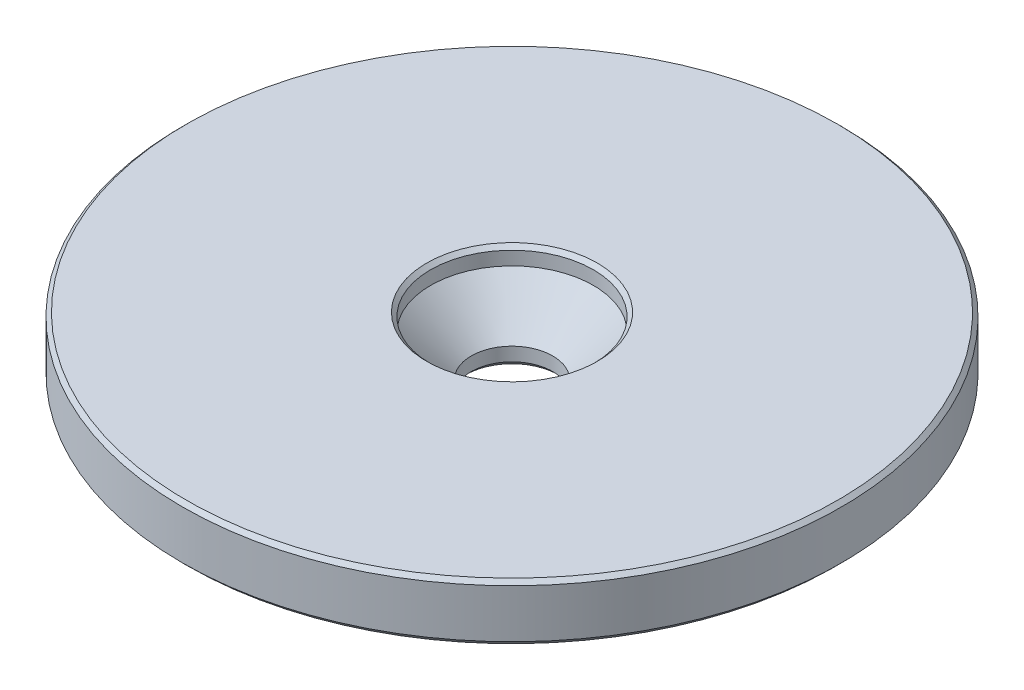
ISO-10303-21;
HEADER;
FILE_DESCRIPTION(('STEP AP214'),'2;1');
FILE_NAME('part.step','',(''),(''),'','','');
FILE_SCHEMA(('AUTOMOTIVE_DESIGN { 1 0 10303 214 1 1 1 1 }'));
ENDSEC;
DATA;
#1=APPLICATION_CONTEXT('core data for automotive mechanical design processes');
#2=APPLICATION_PROTOCOL_DEFINITION('international standard','automotive_design',2000,#1);
#3=PRODUCT_CONTEXT('',#1,'mechanical');
#4=PRODUCT('Part','Part','',(#3));
#5=PRODUCT_RELATED_PRODUCT_CATEGORY('part','',(#4));
#6=PRODUCT_DEFINITION_FORMATION('','',#4);
#7=PRODUCT_DEFINITION_CONTEXT('part definition',#1,'design');
#8=PRODUCT_DEFINITION('design','',#6,#7);
#9=PRODUCT_DEFINITION_SHAPE('','',#8);
#10=(LENGTH_UNIT() NAMED_UNIT(*) SI_UNIT(.MILLI.,.METRE.));
#11=(NAMED_UNIT(*) PLANE_ANGLE_UNIT() SI_UNIT($,.RADIAN.));
#12=(NAMED_UNIT(*) SI_UNIT($,.STERADIAN.) SOLID_ANGLE_UNIT());
#13=UNCERTAINTY_MEASURE_WITH_UNIT(LENGTH_MEASURE(1.E-05),#10,'distance_accuracy_value','');
#14=(GEOMETRIC_REPRESENTATION_CONTEXT(3) GLOBAL_UNCERTAINTY_ASSIGNED_CONTEXT((#13)) GLOBAL_UNIT_ASSIGNED_CONTEXT((#10,
#11,#12)) REPRESENTATION_CONTEXT('',''));
#15=CARTESIAN_POINT('',(0.,0.,0.));
#16=DIRECTION('',(0.,0.,1.));
#17=DIRECTION('',(1.,0.,0.));
#18=AXIS2_PLACEMENT_3D('',#15,#16,#17);
#19=CARTESIAN_POINT('',(-8.,0.,0.));
#20=DIRECTION('',(0.,1.,0.));
#21=DIRECTION('',(0.,0.,1.));
#22=AXIS2_PLACEMENT_3D('',#19,#20,#21);
#23=PLANE('',#22);
#24=CARTESIAN_POINT('',(0.,0.,0.));
#25=DIRECTION('',(0.,1.,0.));
#26=DIRECTION('',(0.,0.,1.));
#27=AXIS2_PLACEMENT_3D('',#24,#25,#26);
#28=CIRCLE('',#27,2.4);
#29=CARTESIAN_POINT('',(0.,0.,2.4));
#30=VERTEX_POINT('',#29);
#31=EDGE_CURVE('E40',#30,#30,#28,.T.);
#32=ORIENTED_EDGE('',*,*,#31,.T.);
#33=EDGE_LOOP('',(#32));
#34=FACE_BOUND('',#33,.T.);
#35=CARTESIAN_POINT('',(0.,0.,0.));
#36=DIRECTION('',(0.,1.,0.));
#37=DIRECTION('',(0.,0.,1.));
#38=AXIS2_PLACEMENT_3D('',#35,#36,#37);
#39=CIRCLE('',#38,7.7);
#40=CARTESIAN_POINT('',(0.,0.,7.7));
#41=VERTEX_POINT('',#40);
#42=EDGE_CURVE('E43',#41,#41,#39,.F.);
#43=ORIENTED_EDGE('',*,*,#42,.T.);
#44=EDGE_LOOP('',(#43));
#45=FACE_BOUND('',#44,.T.);
#46=ADVANCED_FACE('F14',(#34,#45),#23,.F.);
#47=CARTESIAN_POINT('',(0.,0.,0.));
#48=DIRECTION('',(0.,1.,0.));
#49=DIRECTION('',(0.,0.,1.));
#50=AXIS2_PLACEMENT_3D('',#47,#48,#49);
#51=CYLINDRICAL_SURFACE('',#50,8.);
#52=CARTESIAN_POINT('',(0.,0.6,0.));
#53=DIRECTION('',(0.,1.,0.));
#54=DIRECTION('',(0.,0.,1.));
#55=AXIS2_PLACEMENT_3D('',#52,#53,#54);
#56=CIRCLE('',#55,8.);
#57=CARTESIAN_POINT('',(0.,0.6,8.));
#58=VERTEX_POINT('',#57);
#59=EDGE_CURVE('E21',#58,#58,#56,.F.);
#60=ORIENTED_EDGE('',*,*,#59,.T.);
#61=EDGE_LOOP('',(#60));
#62=FACE_BOUND('',#61,.T.);
#63=CARTESIAN_POINT('',(0.,0.300000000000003,0.));
#64=DIRECTION('',(0.,1.,0.));
#65=DIRECTION('',(0.,0.,1.));
#66=AXIS2_PLACEMENT_3D('',#63,#64,#65);
#67=CIRCLE('',#66,8.);
#68=CARTESIAN_POINT('',(0.,0.300000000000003,8.));
#69=VERTEX_POINT('',#68);
#70=EDGE_CURVE('E34',#69,#69,#67,.T.);
#71=ORIENTED_EDGE('',*,*,#70,.T.);
#72=EDGE_LOOP('',(#71));
#73=FACE_BOUND('',#72,.T.);
#74=ADVANCED_FACE('F98',(#62,#73),#51,.T.);
#75=CARTESIAN_POINT('',(0.,0.,0.));
#76=DIRECTION('',(0.,1.,0.));
#77=DIRECTION('',(0.,0.,1.));
#78=AXIS2_PLACEMENT_3D('',#75,#76,#77);
#79=CYLINDRICAL_SURFACE('',#78,2.1);
#80=CARTESIAN_POINT('',(0.,0.299999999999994,0.));
#81=DIRECTION('',(0.,1.,0.));
#82=DIRECTION('',(0.,0.,1.));
#83=AXIS2_PLACEMENT_3D('',#80,#81,#82);
#84=CIRCLE('',#83,2.1);
#85=CARTESIAN_POINT('',(0.,0.299999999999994,2.1));
#86=VERTEX_POINT('',#85);
#87=EDGE_CURVE('E37',#86,#86,#84,.F.);
#88=ORIENTED_EDGE('',*,*,#87,.T.);
#89=EDGE_LOOP('',(#88));
#90=FACE_BOUND('',#89,.T.);
#91=CARTESIAN_POINT('',(0.,0.999999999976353,0.));
#92=DIRECTION('',(0.,1.,0.));
#93=DIRECTION('',(0.,0.,1.));
#94=AXIS2_PLACEMENT_3D('',#91,#92,#93);
#95=CIRCLE('',#94,2.09999999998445);
#96=CARTESIAN_POINT('',(0.,0.999999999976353,2.09999999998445));
#97=VERTEX_POINT('',#96);
#98=EDGE_CURVE('E61',#97,#97,#95,.T.);
#99=ORIENTED_EDGE('',*,*,#98,.T.);
#100=EDGE_LOOP('',(#99));
#101=FACE_BOUND('',#100,.T.);
#102=ADVANCED_FACE('F95',(#90,#101),#79,.F.);
#103=CARTESIAN_POINT('',(-17.,1.,0.));
#104=DIRECTION('',(0.,1.,0.));
#105=DIRECTION('',(0.,0.,1.));
#106=AXIS2_PLACEMENT_3D('',#103,#104,#105);
#107=PLANE('',#106);
#108=CARTESIAN_POINT('',(0.,1.,0.));
#109=DIRECTION('',(0.,1.,0.));
#110=DIRECTION('',(0.,0.,1.));
#111=AXIS2_PLACEMENT_3D('',#108,#109,#110);
#112=CIRCLE('',#111,8.4);
#113=CARTESIAN_POINT('',(0.,1.,8.4));
#114=VERTEX_POINT('',#113);
#115=EDGE_CURVE('E10',#114,#114,#112,.T.);
#116=ORIENTED_EDGE('',*,*,#115,.T.);
#117=EDGE_LOOP('',(#116));
#118=FACE_BOUND('',#117,.T.);
#119=CARTESIAN_POINT('',(0.,1.,0.));
#120=DIRECTION('',(0.,1.,0.));
#121=DIRECTION('',(0.,0.,1.));
#122=AXIS2_PLACEMENT_3D('',#119,#120,#121);
#123=CIRCLE('',#122,16.7);
#124=CARTESIAN_POINT('',(0.,1.,16.7));
#125=VERTEX_POINT('',#124);
#126=EDGE_CURVE('E25',#125,#125,#123,.F.);
#127=ORIENTED_EDGE('',*,*,#126,.T.);
#128=EDGE_LOOP('',(#127));
#129=FACE_BOUND('',#128,.T.);
#130=ADVANCED_FACE('F91',(#118,#129),#107,.F.);
#131=CARTESIAN_POINT('',(0.,3.09999999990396,0.));
#132=DIRECTION('',(0.,1.,0.));
#133=DIRECTION('',(0.,0.,1.));
#134=AXIS2_PLACEMENT_3D('',#131,#132,#133);
#135=CONICAL_SURFACE('',#134,4.19999999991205,0.785398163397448);
#136=ORIENTED_EDGE('',*,*,#98,.F.);
#137=EDGE_LOOP('',(#136));
#138=FACE_BOUND('',#137,.T.);
#139=CARTESIAN_POINT('',(0.,3.1,0.));
#140=DIRECTION('',(0.,1.,0.));
#141=DIRECTION('',(0.,0.,1.));
#142=AXIS2_PLACEMENT_3D('',#139,#140,#141);
#143=CIRCLE('',#142,4.2);
#144=CARTESIAN_POINT('',(0.,3.1,4.2));
#145=VERTEX_POINT('',#144);
#146=EDGE_CURVE('E58',#145,#145,#143,.T.);
#147=ORIENTED_EDGE('',*,*,#146,.T.);
#148=EDGE_LOOP('',(#147));
#149=FACE_BOUND('',#148,.T.);
#150=ADVANCED_FACE('F69',(#138,#149),#135,.F.);
#151=CARTESIAN_POINT('',(0.,0.,0.));
#152=DIRECTION('',(0.,1.,0.));
#153=DIRECTION('',(0.,0.,1.));
#154=AXIS2_PLACEMENT_3D('',#151,#152,#153);
#155=CYLINDRICAL_SURFACE('',#154,17.);
#156=CARTESIAN_POINT('',(0.,1.3,0.));
#157=DIRECTION('',(0.,1.,0.));
#158=DIRECTION('',(0.,0.,1.));
#159=AXIS2_PLACEMENT_3D('',#156,#157,#158);
#160=CIRCLE('',#159,17.);
#161=CARTESIAN_POINT('',(0.,1.3,17.));
#162=VERTEX_POINT('',#161);
#163=EDGE_CURVE('E29',#162,#162,#160,.T.);
#164=ORIENTED_EDGE('',*,*,#163,.T.);
#165=EDGE_LOOP('',(#164));
#166=FACE_BOUND('',#165,.T.);
#167=CARTESIAN_POINT('',(0.,3.8,0.));
#168=DIRECTION('',(0.,-1.,0.));
#169=DIRECTION('',(0.,0.,-1.));
#170=AXIS2_PLACEMENT_3D('',#167,#168,#169);
#171=CIRCLE('',#170,17.);
#172=CARTESIAN_POINT('',(0.,3.8,-17.));
#173=VERTEX_POINT('',#172);
#174=EDGE_CURVE('E46',#173,#173,#171,.T.);
#175=ORIENTED_EDGE('',*,*,#174,.T.);
#176=EDGE_LOOP('',(#175));
#177=FACE_BOUND('',#176,.T.);
#178=ADVANCED_FACE('F74',(#166,#177),#155,.T.);
#179=CARTESIAN_POINT('',(0.,0.,0.));
#180=DIRECTION('',(0.,1.,0.));
#181=DIRECTION('',(0.,0.,1.));
#182=AXIS2_PLACEMENT_3D('',#179,#180,#181);
#183=CYLINDRICAL_SURFACE('',#182,4.2);
#184=CARTESIAN_POINT('',(0.,3.8,0.));
#185=DIRECTION('',(0.,-1.,0.));
#186=DIRECTION('',(0.,0.,-1.));
#187=AXIS2_PLACEMENT_3D('',#184,#185,#186);
#188=CIRCLE('',#187,4.2);
#189=CARTESIAN_POINT('',(0.,3.8,-4.2));
#190=VERTEX_POINT('',#189);
#191=EDGE_CURVE('E55',#190,#190,#188,.F.);
#192=ORIENTED_EDGE('',*,*,#191,.T.);
#193=EDGE_LOOP('',(#192));
#194=FACE_BOUND('',#193,.T.);
#195=ORIENTED_EDGE('',*,*,#146,.F.);
#196=EDGE_LOOP('',(#195));
#197=FACE_BOUND('',#196,.T.);
#198=ADVANCED_FACE('F71',(#194,#197),#183,.F.);
#199=CARTESIAN_POINT('',(-4.2,4.,0.));
#200=DIRECTION('',(0.,-1.,0.));
#201=DIRECTION('',(0.,0.,-1.));
#202=AXIS2_PLACEMENT_3D('',#199,#200,#201);
#203=PLANE('',#202);
#204=CARTESIAN_POINT('',(0.,4.,0.));
#205=DIRECTION('',(0.,-1.,0.));
#206=DIRECTION('',(0.,0.,-1.));
#207=AXIS2_PLACEMENT_3D('',#204,#205,#206);
#208=CIRCLE('',#207,4.4);
#209=CARTESIAN_POINT('',(0.,4.,-4.4));
#210=VERTEX_POINT('',#209);
#211=EDGE_CURVE('E49',#210,#210,#208,.T.);
#212=ORIENTED_EDGE('',*,*,#211,.T.);
#213=EDGE_LOOP('',(#212));
#214=FACE_BOUND('',#213,.T.);
#215=CARTESIAN_POINT('',(0.,4.,0.));
#216=DIRECTION('',(0.,-1.,0.));
#217=DIRECTION('',(0.,0.,-1.));
#218=AXIS2_PLACEMENT_3D('',#215,#216,#217);
#219=CIRCLE('',#218,16.8);
#220=CARTESIAN_POINT('',(0.,4.,-16.8));
#221=VERTEX_POINT('',#220);
#222=EDGE_CURVE('E52',#221,#221,#219,.F.);
#223=ORIENTED_EDGE('',*,*,#222,.T.);
#224=EDGE_LOOP('',(#223));
#225=FACE_BOUND('',#224,.T.);
#226=ADVANCED_FACE('F73',(#214,#225),#203,.F.);
#227=CARTESIAN_POINT('',(0.,3.8,0.));
#228=DIRECTION('',(0.,1.,0.));
#229=DIRECTION('',(0.,0.,1.));
#230=AXIS2_PLACEMENT_3D('',#227,#228,#229);
#231=CONICAL_SURFACE('',#230,4.2,0.785398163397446);
#232=ORIENTED_EDGE('',*,*,#211,.F.);
#233=EDGE_LOOP('',(#232));
#234=FACE_BOUND('',#233,.T.);
#235=ORIENTED_EDGE('',*,*,#191,.F.);
#236=EDGE_LOOP('',(#235));
#237=FACE_BOUND('',#236,.T.);
#238=ADVANCED_FACE('F83',(#234,#237),#231,.F.);
#239=CARTESIAN_POINT('',(0.,3.8,0.));
#240=DIRECTION('',(0.,-1.,0.));
#241=DIRECTION('',(0.,0.,-1.));
#242=AXIS2_PLACEMENT_3D('',#239,#240,#241);
#243=CONICAL_SURFACE('',#242,17.,0.785398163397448);
#244=ORIENTED_EDGE('',*,*,#222,.F.);
#245=EDGE_LOOP('',(#244));
#246=FACE_BOUND('',#245,.T.);
#247=ORIENTED_EDGE('',*,*,#174,.F.);
#248=EDGE_LOOP('',(#247));
#249=FACE_BOUND('',#248,.T.);
#250=ADVANCED_FACE('F107',(#246,#249),#243,.T.);
#251=CARTESIAN_POINT('',(0.,0.,0.));
#252=DIRECTION('',(0.,-1.,0.));
#253=DIRECTION('',(0.,0.,-1.));
#254=AXIS2_PLACEMENT_3D('',#251,#252,#253);
#255=CONICAL_SURFACE('',#254,2.4,0.785398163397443);
#256=ORIENTED_EDGE('',*,*,#87,.F.);
#257=EDGE_LOOP('',(#256));
#258=FACE_BOUND('',#257,.T.);
#259=ORIENTED_EDGE('',*,*,#31,.F.);
#260=EDGE_LOOP('',(#259));
#261=FACE_BOUND('',#260,.T.);
#262=ADVANCED_FACE('F111',(#258,#261),#255,.F.);
#263=CARTESIAN_POINT('',(0.,0.300000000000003,0.));
#264=DIRECTION('',(0.,1.,0.));
#265=DIRECTION('',(0.,0.,1.));
#266=AXIS2_PLACEMENT_3D('',#263,#264,#265);
#267=CONICAL_SURFACE('',#266,8.,0.785398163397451);
#268=ORIENTED_EDGE('',*,*,#42,.F.);
#269=EDGE_LOOP('',(#268));
#270=FACE_BOUND('',#269,.T.);
#271=ORIENTED_EDGE('',*,*,#70,.F.);
#272=EDGE_LOOP('',(#271));
#273=FACE_BOUND('',#272,.T.);
#274=ADVANCED_FACE('F115',(#270,#273),#267,.T.);
#275=CARTESIAN_POINT('',(0.,1.3,0.));
#276=DIRECTION('',(0.,1.,0.));
#277=DIRECTION('',(0.,0.,1.));
#278=AXIS2_PLACEMENT_3D('',#275,#276,#277);
#279=CONICAL_SURFACE('',#278,17.,0.785398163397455);
#280=ORIENTED_EDGE('',*,*,#126,.F.);
#281=EDGE_LOOP('',(#280));
#282=FACE_BOUND('',#281,.T.);
#283=ORIENTED_EDGE('',*,*,#163,.F.);
#284=EDGE_LOOP('',(#283));
#285=FACE_BOUND('',#284,.T.);
#286=ADVANCED_FACE('F118',(#282,#285),#279,.T.);
#287=CARTESIAN_POINT('',(0.,0.6,0.));
#288=DIRECTION('',(0.,1.,0.));
#289=DIRECTION('',(0.,0.,1.));
#290=AXIS2_PLACEMENT_3D('',#287,#288,#289);
#291=TOROIDAL_SURFACE('',#290,8.4,0.4);
#292=ORIENTED_EDGE('',*,*,#115,.F.);
#293=EDGE_LOOP('',(#292));
#294=FACE_BOUND('',#293,.T.);
#295=ORIENTED_EDGE('',*,*,#59,.F.);
#296=EDGE_LOOP('',(#295));
#297=FACE_BOUND('',#296,.T.);
#298=ADVANCED_FACE('F16',(#294,#297),#291,.F.);
#299=CLOSED_SHELL('',(#46,#74,#102,#130,#150,#178,#198,#226,#238,#250,#262,#274,#286,#298));
#300=MANIFOLD_SOLID_BREP('B1',#299);
#301=ADVANCED_BREP_SHAPE_REPRESENTATION('',(#18,#300),#14);
#302=SHAPE_DEFINITION_REPRESENTATION(#9,#301);
ENDSEC;
END-ISO-10303-21;
